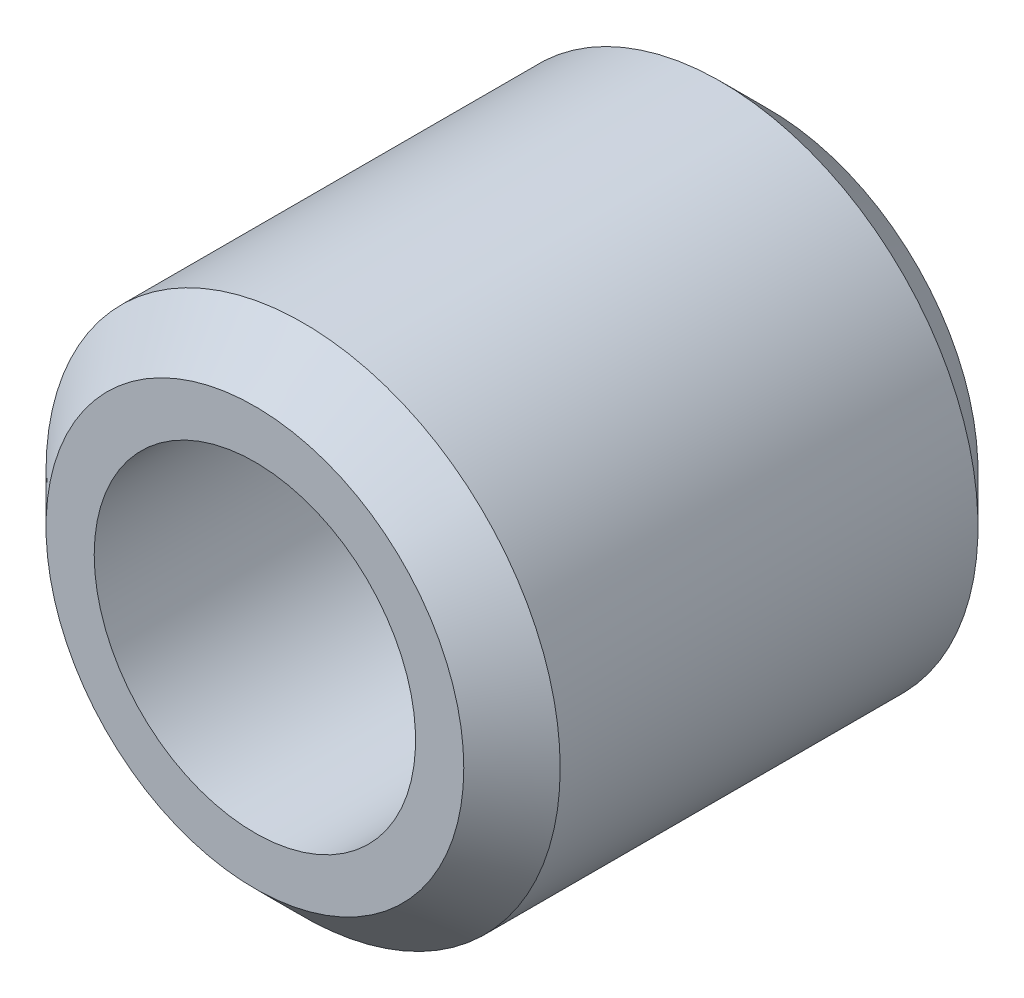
ISO-10303-21;
HEADER;
FILE_DESCRIPTION(('STEP AP214'),'2;1');
FILE_NAME('part.step','',(''),(''),'','','');
FILE_SCHEMA(('AUTOMOTIVE_DESIGN { 1 0 10303 214 1 1 1 1 }'));
ENDSEC;
DATA;
#1=APPLICATION_CONTEXT('core data for automotive mechanical design processes');
#2=APPLICATION_PROTOCOL_DEFINITION('international standard','automotive_design',2000,#1);
#3=PRODUCT_CONTEXT('',#1,'mechanical');
#4=PRODUCT('Part','Part','',(#3));
#5=PRODUCT_RELATED_PRODUCT_CATEGORY('part','',(#4));
#6=PRODUCT_DEFINITION_FORMATION('','',#4);
#7=PRODUCT_DEFINITION_CONTEXT('part definition',#1,'design');
#8=PRODUCT_DEFINITION('design','',#6,#7);
#9=PRODUCT_DEFINITION_SHAPE('','',#8);
#10=(LENGTH_UNIT() NAMED_UNIT(*) SI_UNIT(.MILLI.,.METRE.));
#11=(NAMED_UNIT(*) PLANE_ANGLE_UNIT() SI_UNIT($,.RADIAN.));
#12=(NAMED_UNIT(*) SI_UNIT($,.STERADIAN.) SOLID_ANGLE_UNIT());
#13=UNCERTAINTY_MEASURE_WITH_UNIT(LENGTH_MEASURE(1.E-05),#10,'distance_accuracy_value','');
#14=(GEOMETRIC_REPRESENTATION_CONTEXT(3) GLOBAL_UNCERTAINTY_ASSIGNED_CONTEXT((#13)) GLOBAL_UNIT_ASSIGNED_CONTEXT((#10,
#11,#12)) REPRESENTATION_CONTEXT('',''));
#15=CARTESIAN_POINT('',(0.,0.,0.));
#16=DIRECTION('',(0.,0.,1.));
#17=DIRECTION('',(1.,0.,0.));
#18=AXIS2_PLACEMENT_3D('',#15,#16,#17);
#19=CARTESIAN_POINT('',(0.,0.,0.));
#20=DIRECTION('',(0.,0.,-1.));
#21=DIRECTION('',(-1.,0.,0.));
#22=AXIS2_PLACEMENT_3D('',#19,#20,#21);
#23=CYLINDRICAL_SURFACE('',#22,2.5);
#24=CARTESIAN_POINT('',(0.,0.,0.));
#25=DIRECTION('',(0.,0.,-1.));
#26=DIRECTION('',(-1.,0.,0.));
#27=AXIS2_PLACEMENT_3D('',#24,#25,#26);
#28=CIRCLE('',#27,2.5);
#29=CARTESIAN_POINT('',(-2.5,0.,0.));
#30=VERTEX_POINT('',#29);
#31=EDGE_CURVE('E34',#30,#30,#28,.T.);
#32=ORIENTED_EDGE('',*,*,#31,.T.);
#33=EDGE_LOOP('',(#32));
#34=FACE_BOUND('',#33,.T.);
#35=CARTESIAN_POINT('',(0.,0.,8.));
#36=DIRECTION('',(0.,0.,-1.));
#37=DIRECTION('',(-1.,0.,0.));
#38=AXIS2_PLACEMENT_3D('',#35,#36,#37);
#39=CIRCLE('',#38,2.5);
#40=CARTESIAN_POINT('',(-2.5,0.,8.));
#41=VERTEX_POINT('',#40);
#42=EDGE_CURVE('E31',#41,#41,#39,.T.);
#43=ORIENTED_EDGE('',*,*,#42,.F.);
#44=EDGE_LOOP('',(#43));
#45=FACE_BOUND('',#44,.T.);
#46=ADVANCED_FACE('F12',(#34,#45),#23,.F.);
#47=CARTESIAN_POINT('',(-2.5,0.,8.));
#48=DIRECTION('',(0.,0.,1.));
#49=DIRECTION('',(1.,0.,0.));
#50=AXIS2_PLACEMENT_3D('',#47,#48,#49);
#51=PLANE('',#50);
#52=CARTESIAN_POINT('',(0.,0.,8.));
#53=DIRECTION('',(0.,0.,1.));
#54=DIRECTION('',(1.,0.,0.));
#55=AXIS2_PLACEMENT_3D('',#52,#53,#54);
#56=CIRCLE('',#55,3.25);
#57=CARTESIAN_POINT('',(3.25,0.,8.));
#58=VERTEX_POINT('',#57);
#59=EDGE_CURVE('E8',#58,#58,#56,.T.);
#60=ORIENTED_EDGE('',*,*,#59,.T.);
#61=EDGE_LOOP('',(#60));
#62=FACE_BOUND('',#61,.T.);
#63=ORIENTED_EDGE('',*,*,#42,.T.);
#64=EDGE_LOOP('',(#63));
#65=FACE_BOUND('',#64,.T.);
#66=ADVANCED_FACE('F55',(#62,#65),#51,.T.);
#67=CARTESIAN_POINT('',(0.,0.,0.));
#68=DIRECTION('',(0.,0.,-1.));
#69=DIRECTION('',(-1.,0.,0.));
#70=AXIS2_PLACEMENT_3D('',#67,#68,#69);
#71=CYLINDRICAL_SURFACE('',#70,4.);
#72=CARTESIAN_POINT('',(0.,0.,0.749999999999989));
#73=DIRECTION('',(0.,0.,-1.));
#74=DIRECTION('',(-1.,0.,0.));
#75=AXIS2_PLACEMENT_3D('',#72,#73,#74);
#76=CIRCLE('',#75,4.);
#77=CARTESIAN_POINT('',(-4.,0.,0.749999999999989));
#78=VERTEX_POINT('',#77);
#79=EDGE_CURVE('E18',#78,#78,#76,.F.);
#80=ORIENTED_EDGE('',*,*,#79,.T.);
#81=EDGE_LOOP('',(#80));
#82=FACE_BOUND('',#81,.T.);
#83=CARTESIAN_POINT('',(0.,0.,7.25));
#84=DIRECTION('',(0.,0.,1.));
#85=DIRECTION('',(1.,0.,0.));
#86=AXIS2_PLACEMENT_3D('',#83,#84,#85);
#87=CIRCLE('',#86,4.);
#88=CARTESIAN_POINT('',(4.,0.,7.25));
#89=VERTEX_POINT('',#88);
#90=EDGE_CURVE('E22',#89,#89,#87,.F.);
#91=ORIENTED_EDGE('',*,*,#90,.T.);
#92=EDGE_LOOP('',(#91));
#93=FACE_BOUND('',#92,.T.);
#94=ADVANCED_FACE('F43',(#82,#93),#71,.T.);
#95=CARTESIAN_POINT('',(-2.5,0.,0.));
#96=DIRECTION('',(0.,0.,-1.));
#97=DIRECTION('',(-1.,0.,0.));
#98=AXIS2_PLACEMENT_3D('',#95,#96,#97);
#99=PLANE('',#98);
#100=CARTESIAN_POINT('',(0.,0.,0.));
#101=DIRECTION('',(0.,0.,-1.));
#102=DIRECTION('',(-1.,0.,0.));
#103=AXIS2_PLACEMENT_3D('',#100,#101,#102);
#104=CIRCLE('',#103,3.25);
#105=CARTESIAN_POINT('',(-3.25,0.,0.));
#106=VERTEX_POINT('',#105);
#107=EDGE_CURVE('E26',#106,#106,#104,.T.);
#108=ORIENTED_EDGE('',*,*,#107,.T.);
#109=EDGE_LOOP('',(#108));
#110=FACE_BOUND('',#109,.T.);
#111=ORIENTED_EDGE('',*,*,#31,.F.);
#112=EDGE_LOOP('',(#111));
#113=FACE_BOUND('',#112,.T.);
#114=ADVANCED_FACE('F40',(#110,#113),#99,.T.);
#115=CARTESIAN_POINT('',(0.,0.,0.));
#116=DIRECTION('',(0.,0.,1.));
#117=DIRECTION('',(1.,0.,0.));
#118=AXIS2_PLACEMENT_3D('',#115,#116,#117);
#119=CONICAL_SURFACE('',#118,3.25,0.785398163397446);
#120=ORIENTED_EDGE('',*,*,#79,.F.);
#121=EDGE_LOOP('',(#120));
#122=FACE_BOUND('',#121,.T.);
#123=ORIENTED_EDGE('',*,*,#107,.F.);
#124=EDGE_LOOP('',(#123));
#125=FACE_BOUND('',#124,.T.);
#126=ADVANCED_FACE('F42',(#122,#125),#119,.T.);
#127=CARTESIAN_POINT('',(0.,0.,7.25));
#128=DIRECTION('',(0.,0.,-1.));
#129=DIRECTION('',(-1.,0.,0.));
#130=AXIS2_PLACEMENT_3D('',#127,#128,#129);
#131=CONICAL_SURFACE('',#130,4.,0.785398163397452);
#132=ORIENTED_EDGE('',*,*,#59,.F.);
#133=EDGE_LOOP('',(#132));
#134=FACE_BOUND('',#133,.T.);
#135=ORIENTED_EDGE('',*,*,#90,.F.);
#136=EDGE_LOOP('',(#135));
#137=FACE_BOUND('',#136,.T.);
#138=ADVANCED_FACE('F52',(#134,#137),#131,.T.);
#139=CLOSED_SHELL('',(#46,#66,#94,#114,#126,#138));
#140=MANIFOLD_SOLID_BREP('B1',#139);
#141=ADVANCED_BREP_SHAPE_REPRESENTATION('',(#18,#140),#14);
#142=SHAPE_DEFINITION_REPRESENTATION(#9,#141);
ENDSEC;
END-ISO-10303-21;
